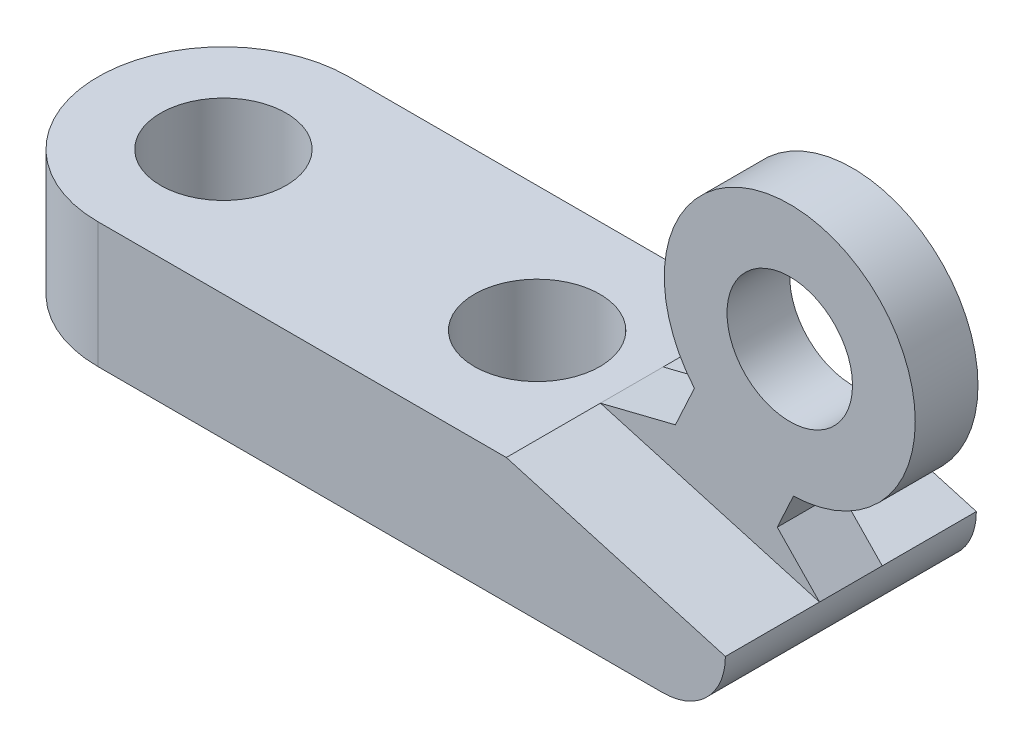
ISO-10303-21;
HEADER;
FILE_DESCRIPTION(('STEP AP214'),'2;1');
FILE_NAME('part.step','',(''),(''),'','','');
FILE_SCHEMA(('AUTOMOTIVE_DESIGN { 1 0 10303 214 1 1 1 1 }'));
ENDSEC;
DATA;
#1=APPLICATION_CONTEXT('core data for automotive mechanical design processes');
#2=APPLICATION_PROTOCOL_DEFINITION('international standard','automotive_design',2000,#1);
#3=PRODUCT_CONTEXT('',#1,'mechanical');
#4=PRODUCT('Part','Part','',(#3));
#5=PRODUCT_RELATED_PRODUCT_CATEGORY('part','',(#4));
#6=PRODUCT_DEFINITION_FORMATION('','',#4);
#7=PRODUCT_DEFINITION_CONTEXT('part definition',#1,'design');
#8=PRODUCT_DEFINITION('design','',#6,#7);
#9=PRODUCT_DEFINITION_SHAPE('','',#8);
#10=(LENGTH_UNIT() NAMED_UNIT(*) SI_UNIT(.MILLI.,.METRE.));
#11=(NAMED_UNIT(*) PLANE_ANGLE_UNIT() SI_UNIT($,.RADIAN.));
#12=(NAMED_UNIT(*) SI_UNIT($,.STERADIAN.) SOLID_ANGLE_UNIT());
#13=UNCERTAINTY_MEASURE_WITH_UNIT(LENGTH_MEASURE(1.E-05),#10,'distance_accuracy_value','');
#14=(GEOMETRIC_REPRESENTATION_CONTEXT(3) GLOBAL_UNCERTAINTY_ASSIGNED_CONTEXT((#13)) GLOBAL_UNIT_ASSIGNED_CONTEXT((#10,
#11,#12)) REPRESENTATION_CONTEXT('',''));
#15=CARTESIAN_POINT('',(0.,0.,0.));
#16=DIRECTION('',(0.,0.,1.));
#17=DIRECTION('',(1.,0.,0.));
#18=AXIS2_PLACEMENT_3D('',#15,#16,#17);
#19=CARTESIAN_POINT('',(3.52133230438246,-1.62558923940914,-0.25));
#20=DIRECTION('',(0.907924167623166,-0.419134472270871,0.));
#21=DIRECTION('',(0.419134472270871,0.907924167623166,0.));
#22=AXIS2_PLACEMENT_3D('',#19,#20,#21);
#23=PLANE('',#22);
#24=DIRECTION('',(0.419134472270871,0.907924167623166,0.));
#25=VECTOR('',#24,1.);
#26=CARTESIAN_POINT('',(3.52133230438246,-1.62558923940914,0.25));
#27=LINE('',#26,#25);
#28=CARTESIAN_POINT('',(4.66340297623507,0.848350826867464,0.25));
#29=VERTEX_POINT('',#28);
#30=CARTESIAN_POINT('',(4.79237589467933,1.12773044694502,0.25));
#31=VERTEX_POINT('',#30);
#32=EDGE_CURVE('E139',#29,#31,#27,.T.);
#33=ORIENTED_EDGE('',*,*,#32,.F.);
#34=DIRECTION('',(0.,0.,1.));
#35=VECTOR('',#34,1.);
#36=CARTESIAN_POINT('',(4.66340297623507,0.848350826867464,-0.25));
#37=LINE('',#36,#35);
#38=CARTESIAN_POINT('',(4.66340297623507,0.848350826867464,-0.25));
#39=VERTEX_POINT('',#38);
#40=EDGE_CURVE('E12',#39,#29,#37,.T.);
#41=ORIENTED_EDGE('',*,*,#40,.F.);
#42=DIRECTION('',(0.419134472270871,0.907924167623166,0.));
#43=VECTOR('',#42,1.);
#44=CARTESIAN_POINT('',(3.52133230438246,-1.62558923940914,-0.25));
#45=LINE('',#44,#43);
#46=CARTESIAN_POINT('',(4.79237589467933,1.12773044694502,-0.25));
#47=VERTEX_POINT('',#46);
#48=EDGE_CURVE('E156',#39,#47,#45,.T.);
#49=ORIENTED_EDGE('',*,*,#48,.T.);
#50=DIRECTION('',(0.,0.,1.));
#51=VECTOR('',#50,1.);
#52=CARTESIAN_POINT('',(4.79237589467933,1.12773044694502,-0.25));
#53=LINE('',#52,#51);
#54=EDGE_CURVE('E54',#47,#31,#53,.T.);
#55=ORIENTED_EDGE('',*,*,#54,.T.);
#56=EDGE_LOOP('',(#33,#41,#49,#55));
#57=FACE_BOUND('',#56,.T.);
#58=ADVANCED_FACE('F51',(#57),#23,.T.);
#59=CARTESIAN_POINT('',(2.8356282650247,2.73995053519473,-0.25));
#60=DIRECTION('',(0.719134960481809,0.694870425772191,0.));
#61=DIRECTION('',(-0.694870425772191,0.719134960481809,0.));
#62=AXIS2_PLACEMENT_3D('',#59,#60,#61);
#63=PLANE('',#62);
#64=DIRECTION('',(-0.694870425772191,0.719134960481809,0.));
#65=VECTOR('',#64,1.);
#66=CARTESIAN_POINT('',(2.8356282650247,2.73995053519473,0.25));
#67=LINE('',#66,#65);
#68=CARTESIAN_POINT('',(5.,0.5,0.25));
#69=VERTEX_POINT('',#68);
#70=EDGE_CURVE('E151',#69,#29,#67,.T.);
#71=ORIENTED_EDGE('',*,*,#70,.F.);
#72=DIRECTION('',(0.,0.,1.));
#73=VECTOR('',#72,1.);
#74=CARTESIAN_POINT('',(5.,0.5,-0.25));
#75=LINE('',#74,#73);
#76=CARTESIAN_POINT('',(5.,0.5,-0.25));
#77=VERTEX_POINT('',#76);
#78=EDGE_CURVE('E60',#77,#69,#75,.T.);
#79=ORIENTED_EDGE('',*,*,#78,.F.);
#80=DIRECTION('',(-0.694870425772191,0.719134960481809,0.));
#81=VECTOR('',#80,1.);
#82=CARTESIAN_POINT('',(2.8356282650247,2.73995053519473,-0.25));
#83=LINE('',#82,#81);
#84=EDGE_CURVE('E117',#77,#39,#83,.T.);
#85=ORIENTED_EDGE('',*,*,#84,.T.);
#86=ORIENTED_EDGE('',*,*,#40,.T.);
#87=EDGE_LOOP('',(#71,#79,#85,#86));
#88=FACE_BOUND('',#87,.T.);
#89=ADVANCED_FACE('F166',(#88),#63,.T.);
#90=CARTESIAN_POINT('',(0.511453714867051,1.78563787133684,-0.25));
#91=DIRECTION('',(0.275353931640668,0.961342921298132,0.));
#92=DIRECTION('',(-0.961342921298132,0.275353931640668,0.));
#93=AXIS2_PLACEMENT_3D('',#90,#91,#92);
#94=PLANE('',#93);
#95=DIRECTION('',(-0.961342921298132,0.275353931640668,0.));
#96=VECTOR('',#95,1.);
#97=CARTESIAN_POINT('',(0.511453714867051,1.78563787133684,0.25));
#98=LINE('',#97,#96);
#99=CARTESIAN_POINT('',(3.25435047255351,1.,0.25));
#100=VERTEX_POINT('',#99);
#101=EDGE_CURVE('E121',#69,#100,#98,.T.);
#102=ORIENTED_EDGE('',*,*,#101,.T.);
#103=DIRECTION('',(0.,0.,1.));
#104=VECTOR('',#103,1.);
#105=CARTESIAN_POINT('',(3.25435047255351,1.,-0.25));
#106=LINE('',#105,#104);
#107=CARTESIAN_POINT('',(3.25435047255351,1.,-0.25));
#108=VERTEX_POINT('',#107);
#109=EDGE_CURVE('E119',#108,#100,#106,.T.);
#110=ORIENTED_EDGE('',*,*,#109,.F.);
#111=DIRECTION('',(-0.961342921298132,0.275353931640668,0.));
#112=VECTOR('',#111,1.);
#113=CARTESIAN_POINT('',(0.511453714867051,1.78563787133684,-0.25));
#114=LINE('',#113,#112);
#115=EDGE_CURVE('E111',#77,#108,#114,.T.);
#116=ORIENTED_EDGE('',*,*,#115,.F.);
#117=ORIENTED_EDGE('',*,*,#78,.T.);
#118=EDGE_LOOP('',(#102,#110,#116,#117));
#119=FACE_BOUND('',#118,.T.);
#120=ADVANCED_FACE('F120',(#119),#94,.F.);
#121=CARTESIAN_POINT('',(-0.044080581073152,0.176575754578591,-0.25));
#122=DIRECTION('',(-0.242207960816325,0.97022435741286,0.));
#123=DIRECTION('',(-0.97022435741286,-0.242207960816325,0.));
#124=AXIS2_PLACEMENT_3D('',#121,#122,#123);
#125=PLANE('',#124);
#126=DIRECTION('',(-0.97022435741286,-0.242207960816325,0.));
#127=VECTOR('',#126,1.);
#128=CARTESIAN_POINT('',(-0.044080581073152,0.176575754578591,0.25));
#129=LINE('',#128,#127);
#130=CARTESIAN_POINT('',(3.85181055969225,1.14915064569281,0.25));
#131=VERTEX_POINT('',#130);
#132=EDGE_CURVE('E148',#131,#100,#129,.T.);
#133=ORIENTED_EDGE('',*,*,#132,.F.);
#134=DIRECTION('',(0.,0.,1.));
#135=VECTOR('',#134,1.);
#136=CARTESIAN_POINT('',(3.85181055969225,1.14915064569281,-0.25));
#137=LINE('',#136,#135);
#138=CARTESIAN_POINT('',(3.85181055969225,1.14915064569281,-0.25));
#139=VERTEX_POINT('',#138);
#140=EDGE_CURVE('E125',#139,#131,#137,.T.);
#141=ORIENTED_EDGE('',*,*,#140,.F.);
#142=DIRECTION('',(-0.97022435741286,-0.242207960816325,0.));
#143=VECTOR('',#142,1.);
#144=CARTESIAN_POINT('',(-0.044080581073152,0.176575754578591,-0.25));
#145=LINE('',#144,#143);
#146=EDGE_CURVE('E116',#139,#108,#145,.T.);
#147=ORIENTED_EDGE('',*,*,#146,.T.);
#148=ORIENTED_EDGE('',*,*,#109,.T.);
#149=EDGE_LOOP('',(#133,#141,#147,#148));
#150=FACE_BOUND('',#149,.T.);
#151=ADVANCED_FACE('F127',(#150),#125,.T.);
#152=CARTESIAN_POINT('',(2.73784827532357,-1.26390136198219,-0.25));
#153=DIRECTION('',(0.907924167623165,-0.419134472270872,0.));
#154=DIRECTION('',(0.419134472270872,0.907924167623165,0.));
#155=AXIS2_PLACEMENT_3D('',#152,#153,#154);
#156=PLANE('',#155);
#157=DIRECTION('',(0.419134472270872,0.907924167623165,0.));
#158=VECTOR('',#157,1.);
#159=CARTESIAN_POINT('',(2.73784827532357,-1.26390136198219,0.25));
#160=LINE('',#159,#158);
#161=CARTESIAN_POINT('',(4.00321309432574,1.47711703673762,0.25));
#162=VERTEX_POINT('',#161);
#163=EDGE_CURVE('E145',#131,#162,#160,.T.);
#164=ORIENTED_EDGE('',*,*,#163,.T.);
#165=DIRECTION('',(0.,0.,1.));
#166=VECTOR('',#165,1.);
#167=CARTESIAN_POINT('',(4.00321309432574,1.47711703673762,-0.25));
#168=LINE('',#167,#166);
#169=CARTESIAN_POINT('',(4.00321309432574,1.47711703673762,-0.25));
#170=VERTEX_POINT('',#169);
#171=EDGE_CURVE('E159',#170,#162,#168,.T.);
#172=ORIENTED_EDGE('',*,*,#171,.F.);
#173=DIRECTION('',(0.419134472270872,0.907924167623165,0.));
#174=VECTOR('',#173,1.);
#175=CARTESIAN_POINT('',(2.73784827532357,-1.26390136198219,-0.25));
#176=LINE('',#175,#174);
#177=EDGE_CURVE('E129',#139,#170,#176,.T.);
#178=ORIENTED_EDGE('',*,*,#177,.F.);
#179=ORIENTED_EDGE('',*,*,#140,.T.);
#180=EDGE_LOOP('',(#164,#172,#178,#179));
#181=FACE_BOUND('',#180,.T.);
#182=ADVANCED_FACE('F180',(#181),#156,.F.);
#183=CARTESIAN_POINT('',(4.76299192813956,2.12729864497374,-0.25));
#184=DIRECTION('',(0.,0.,1.));
#185=DIRECTION('',(1.,0.,0.));
#186=AXIS2_PLACEMENT_3D('',#183,#184,#185);
#187=CYLINDRICAL_SURFACE('',#186,1.);
#188=CARTESIAN_POINT('',(4.76299192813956,2.12729864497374,0.25));
#189=DIRECTION('',(0.,0.,1.));
#190=DIRECTION('',(1.,0.,0.));
#191=AXIS2_PLACEMENT_3D('',#188,#189,#190);
#192=CIRCLE('',#191,1.);
#193=EDGE_CURVE('E142',#31,#162,#192,.T.);
#194=ORIENTED_EDGE('',*,*,#193,.F.);
#195=ORIENTED_EDGE('',*,*,#54,.F.);
#196=CARTESIAN_POINT('',(4.76299192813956,2.12729864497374,-0.25));
#197=DIRECTION('',(0.,0.,1.));
#198=DIRECTION('',(1.,0.,0.));
#199=AXIS2_PLACEMENT_3D('',#196,#197,#198);
#200=CIRCLE('',#199,1.);
#201=EDGE_CURVE('E131',#47,#170,#200,.T.);
#202=ORIENTED_EDGE('',*,*,#201,.T.);
#203=ORIENTED_EDGE('',*,*,#171,.T.);
#204=EDGE_LOOP('',(#194,#195,#202,#203));
#205=FACE_BOUND('',#204,.T.);
#206=ADVANCED_FACE('F161',(#205),#187,.T.);
#207=CARTESIAN_POINT('',(4.76299192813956,2.12729864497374,-0.25));
#208=DIRECTION('',(0.,0.,1.));
#209=DIRECTION('',(1.,0.,0.));
#210=AXIS2_PLACEMENT_3D('',#207,#208,#209);
#211=CYLINDRICAL_SURFACE('',#210,0.500000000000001);
#212=CARTESIAN_POINT('',(4.76299192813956,2.12729864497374,-0.25));
#213=DIRECTION('',(0.,0.,1.));
#214=DIRECTION('',(1.,0.,0.));
#215=AXIS2_PLACEMENT_3D('',#212,#213,#214);
#216=CIRCLE('',#215,0.500000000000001);
#217=CARTESIAN_POINT('',(5.26299192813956,2.12729864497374,-0.25));
#218=VERTEX_POINT('',#217);
#219=EDGE_CURVE('E136',#218,#218,#216,.T.);
#220=ORIENTED_EDGE('',*,*,#219,.F.);
#221=EDGE_LOOP('',(#220));
#222=FACE_BOUND('',#221,.T.);
#223=CARTESIAN_POINT('',(4.76299192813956,2.12729864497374,0.25));
#224=DIRECTION('',(0.,0.,1.));
#225=DIRECTION('',(1.,0.,0.));
#226=AXIS2_PLACEMENT_3D('',#223,#224,#225);
#227=CIRCLE('',#226,0.500000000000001);
#228=CARTESIAN_POINT('',(5.26299192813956,2.12729864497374,0.25));
#229=VERTEX_POINT('',#228);
#230=EDGE_CURVE('E154',#229,#229,#227,.T.);
#231=ORIENTED_EDGE('',*,*,#230,.T.);
#232=EDGE_LOOP('',(#231));
#233=FACE_BOUND('',#232,.T.);
#234=ADVANCED_FACE('F175',(#222,#233),#211,.F.);
#235=CARTESIAN_POINT('',(0.,0.,-0.25));
#236=DIRECTION('',(0.,0.,1.));
#237=DIRECTION('',(1.,0.,0.));
#238=AXIS2_PLACEMENT_3D('',#235,#236,#237);
#239=PLANE('',#238);
#240=ORIENTED_EDGE('',*,*,#48,.F.);
#241=ORIENTED_EDGE('',*,*,#84,.F.);
#242=ORIENTED_EDGE('',*,*,#115,.T.);
#243=ORIENTED_EDGE('',*,*,#146,.F.);
#244=ORIENTED_EDGE('',*,*,#177,.T.);
#245=ORIENTED_EDGE('',*,*,#201,.F.);
#246=EDGE_LOOP('',(#240,#241,#242,#243,#244,#245));
#247=FACE_BOUND('',#246,.T.);
#248=ORIENTED_EDGE('',*,*,#219,.T.);
#249=EDGE_LOOP('',(#248));
#250=FACE_BOUND('',#249,.T.);
#251=ADVANCED_FACE('F113',(#247,#250),#239,.F.);
#252=CARTESIAN_POINT('',(0.,0.,0.25));
#253=DIRECTION('',(0.,0.,1.));
#254=DIRECTION('',(1.,0.,0.));
#255=AXIS2_PLACEMENT_3D('',#252,#253,#254);
#256=PLANE('',#255);
#257=ORIENTED_EDGE('',*,*,#32,.T.);
#258=ORIENTED_EDGE('',*,*,#193,.T.);
#259=ORIENTED_EDGE('',*,*,#163,.F.);
#260=ORIENTED_EDGE('',*,*,#132,.T.);
#261=ORIENTED_EDGE('',*,*,#101,.F.);
#262=ORIENTED_EDGE('',*,*,#70,.T.);
#263=EDGE_LOOP('',(#257,#258,#259,#260,#261,#262));
#264=FACE_BOUND('',#263,.T.);
#265=ORIENTED_EDGE('',*,*,#230,.F.);
#266=EDGE_LOOP('',(#265));
#267=FACE_BOUND('',#266,.T.);
#268=ADVANCED_FACE('F164',(#264,#267),#256,.T.);
#269=CLOSED_SHELL('',(#58,#89,#120,#151,#182,#206,#234,#251,#268));
#270=MANIFOLD_SOLID_BREP('B2',#269);
#271=CARTESIAN_POINT('',(0.,1.,-1.));
#272=DIRECTION('',(0.,0.,-1.));
#273=DIRECTION('',(-1.,0.,0.));
#274=AXIS2_PLACEMENT_3D('',#271,#272,#273);
#275=PLANE('',#274);
#276=DIRECTION('',(0.961342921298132,-0.275353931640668,0.));
#277=VECTOR('',#276,1.);
#278=CARTESIAN_POINT('',(5.,0.5,-1.));
#279=LINE('',#278,#277);
#280=CARTESIAN_POINT('',(3.25435047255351,1.,-1.));
#281=VERTEX_POINT('',#280);
#282=CARTESIAN_POINT('',(5.,0.5,-1.));
#283=VERTEX_POINT('',#282);
#284=EDGE_CURVE('E309',#281,#283,#279,.T.);
#285=ORIENTED_EDGE('',*,*,#284,.T.);
#286=CARTESIAN_POINT('',(4.5,0.5,-1.));
#287=DIRECTION('',(0.,0.,-1.));
#288=DIRECTION('',(-1.,0.,0.));
#289=AXIS2_PLACEMENT_3D('',#286,#287,#288);
#290=CIRCLE('',#289,0.5);
#291=CARTESIAN_POINT('',(4.5,0.,-1.));
#292=VERTEX_POINT('',#291);
#293=EDGE_CURVE('E285',#283,#292,#290,.T.);
#294=ORIENTED_EDGE('',*,*,#293,.T.);
#295=DIRECTION('',(1.,0.,0.));
#296=VECTOR('',#295,1.);
#297=CARTESIAN_POINT('',(0.,0.,-1.));
#298=LINE('',#297,#296);
#299=CARTESIAN_POINT('',(0.,0.,-1.));
#300=VERTEX_POINT('',#299);
#301=EDGE_CURVE('E346',#300,#292,#298,.T.);
#302=ORIENTED_EDGE('',*,*,#301,.F.);
#303=DIRECTION('',(0.,-1.,0.));
#304=VECTOR('',#303,1.);
#305=CARTESIAN_POINT('',(0.,1.,-1.));
#306=LINE('',#305,#304);
#307=CARTESIAN_POINT('',(0.,1.,-1.));
#308=VERTEX_POINT('',#307);
#309=EDGE_CURVE('E329',#308,#300,#306,.T.);
#310=ORIENTED_EDGE('',*,*,#309,.F.);
#311=DIRECTION('',(1.,0.,0.));
#312=VECTOR('',#311,1.);
#313=CARTESIAN_POINT('',(0.,1.,-1.));
#314=LINE('',#313,#312);
#315=EDGE_CURVE('E325',#308,#281,#314,.T.);
#316=ORIENTED_EDGE('',*,*,#315,.T.);
#317=EDGE_LOOP('',(#285,#294,#302,#310,#316));
#318=FACE_BOUND('',#317,.T.);
#319=ADVANCED_FACE('F263',(#318),#275,.T.);
#320=CARTESIAN_POINT('',(0.,1.,0.));
#321=DIRECTION('',(0.,-1.,0.));
#322=DIRECTION('',(0.,0.,-1.));
#323=AXIS2_PLACEMENT_3D('',#320,#321,#322);
#324=CYLINDRICAL_SURFACE('',#323,1.);
#325=CARTESIAN_POINT('',(0.,0.,0.));
#326=DIRECTION('',(0.,1.,0.));
#327=DIRECTION('',(0.,0.,1.));
#328=AXIS2_PLACEMENT_3D('',#325,#326,#327);
#329=CIRCLE('',#328,1.);
#330=CARTESIAN_POINT('',(0.,0.,1.));
#331=VERTEX_POINT('',#330);
#332=EDGE_CURVE('E348',#300,#331,#329,.T.);
#333=ORIENTED_EDGE('',*,*,#332,.T.);
#334=DIRECTION('',(0.,-1.,0.));
#335=VECTOR('',#334,1.);
#336=CARTESIAN_POINT('',(0.,1.,1.));
#337=LINE('',#336,#335);
#338=CARTESIAN_POINT('',(0.,1.,1.));
#339=VERTEX_POINT('',#338);
#340=EDGE_CURVE('E343',#339,#331,#337,.T.);
#341=ORIENTED_EDGE('',*,*,#340,.F.);
#342=CARTESIAN_POINT('',(0.,1.,0.));
#343=DIRECTION('',(0.,1.,0.));
#344=DIRECTION('',(0.,0.,1.));
#345=AXIS2_PLACEMENT_3D('',#342,#343,#344);
#346=CIRCLE('',#345,1.);
#347=EDGE_CURVE('E331',#308,#339,#346,.T.);
#348=ORIENTED_EDGE('',*,*,#347,.F.);
#349=ORIENTED_EDGE('',*,*,#309,.T.);
#350=EDGE_LOOP('',(#333,#341,#348,#349));
#351=FACE_BOUND('',#350,.T.);
#352=ADVANCED_FACE('F361',(#351),#324,.T.);
#353=CARTESIAN_POINT('',(0.,1.,1.));
#354=DIRECTION('',(0.,0.,-1.));
#355=DIRECTION('',(-1.,0.,0.));
#356=AXIS2_PLACEMENT_3D('',#353,#354,#355);
#357=PLANE('',#356);
#358=CARTESIAN_POINT('',(4.5,0.5,1.));
#359=DIRECTION('',(0.,0.,-1.));
#360=DIRECTION('',(-1.,0.,0.));
#361=AXIS2_PLACEMENT_3D('',#358,#359,#360);
#362=CIRCLE('',#361,0.5);
#363=CARTESIAN_POINT('',(4.5,0.,1.));
#364=VERTEX_POINT('',#363);
#365=CARTESIAN_POINT('',(5.,0.5,1.));
#366=VERTEX_POINT('',#365);
#367=EDGE_CURVE('E49',#364,#366,#362,.F.);
#368=ORIENTED_EDGE('',*,*,#367,.T.);
#369=DIRECTION('',(0.961342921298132,-0.275353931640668,0.));
#370=VECTOR('',#369,1.);
#371=CARTESIAN_POINT('',(5.,0.5,1.));
#372=LINE('',#371,#370);
#373=CARTESIAN_POINT('',(3.25435047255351,1.,1.));
#374=VERTEX_POINT('',#373);
#375=EDGE_CURVE('E327',#374,#366,#372,.T.);
#376=ORIENTED_EDGE('',*,*,#375,.F.);
#377=DIRECTION('',(1.,0.,0.));
#378=VECTOR('',#377,1.);
#379=CARTESIAN_POINT('',(0.,1.,1.));
#380=LINE('',#379,#378);
#381=EDGE_CURVE('E326',#339,#374,#380,.T.);
#382=ORIENTED_EDGE('',*,*,#381,.F.);
#383=ORIENTED_EDGE('',*,*,#340,.T.);
#384=DIRECTION('',(1.,0.,0.));
#385=VECTOR('',#384,1.);
#386=CARTESIAN_POINT('',(0.,0.,1.));
#387=LINE('',#386,#385);
#388=EDGE_CURVE('E351',#331,#364,#387,.T.);
#389=ORIENTED_EDGE('',*,*,#388,.T.);
#390=EDGE_LOOP('',(#368,#376,#382,#383,#389));
#391=FACE_BOUND('',#390,.T.);
#392=ADVANCED_FACE('F367',(#391),#357,.F.);
#393=CARTESIAN_POINT('',(2.5,1.,0.));
#394=DIRECTION('',(0.,-1.,0.));
#395=DIRECTION('',(0.,0.,-1.));
#396=AXIS2_PLACEMENT_3D('',#393,#394,#395);
#397=CYLINDRICAL_SURFACE('',#396,0.5);
#398=CARTESIAN_POINT('',(2.5,1.,0.));
#399=DIRECTION('',(0.,1.,0.));
#400=DIRECTION('',(0.,0.,1.));
#401=AXIS2_PLACEMENT_3D('',#398,#399,#400);
#402=CIRCLE('',#401,0.5);
#403=CARTESIAN_POINT('',(2.5,1.,0.5));
#404=VERTEX_POINT('',#403);
#405=EDGE_CURVE('E332',#404,#404,#402,.T.);
#406=ORIENTED_EDGE('',*,*,#405,.T.);
#407=EDGE_LOOP('',(#406));
#408=FACE_BOUND('',#407,.T.);
#409=CARTESIAN_POINT('',(2.5,0.,0.));
#410=DIRECTION('',(0.,1.,0.));
#411=DIRECTION('',(0.,0.,1.));
#412=AXIS2_PLACEMENT_3D('',#409,#410,#411);
#413=CIRCLE('',#412,0.5);
#414=CARTESIAN_POINT('',(2.5,0.,0.5));
#415=VERTEX_POINT('',#414);
#416=EDGE_CURVE('E317',#415,#415,#413,.T.);
#417=ORIENTED_EDGE('',*,*,#416,.F.);
#418=EDGE_LOOP('',(#417));
#419=FACE_BOUND('',#418,.T.);
#420=ADVANCED_FACE('F387',(#408,#419),#397,.F.);
#421=CARTESIAN_POINT('',(0.,1.,0.));
#422=DIRECTION('',(0.,-1.,0.));
#423=DIRECTION('',(0.,0.,-1.));
#424=AXIS2_PLACEMENT_3D('',#421,#422,#423);
#425=CYLINDRICAL_SURFACE('',#424,0.5);
#426=CARTESIAN_POINT('',(0.,1.,0.));
#427=DIRECTION('',(0.,1.,0.));
#428=DIRECTION('',(0.,0.,1.));
#429=AXIS2_PLACEMENT_3D('',#426,#427,#428);
#430=CIRCLE('',#429,0.5);
#431=CARTESIAN_POINT('',(0.,1.,0.5));
#432=VERTEX_POINT('',#431);
#433=EDGE_CURVE('E340',#432,#432,#430,.T.);
#434=ORIENTED_EDGE('',*,*,#433,.T.);
#435=EDGE_LOOP('',(#434));
#436=FACE_BOUND('',#435,.T.);
#437=CARTESIAN_POINT('',(0.,0.,0.));
#438=DIRECTION('',(0.,1.,0.));
#439=DIRECTION('',(0.,0.,1.));
#440=AXIS2_PLACEMENT_3D('',#437,#438,#439);
#441=CIRCLE('',#440,0.5);
#442=CARTESIAN_POINT('',(0.,0.,0.5));
#443=VERTEX_POINT('',#442);
#444=EDGE_CURVE('E336',#443,#443,#441,.T.);
#445=ORIENTED_EDGE('',*,*,#444,.F.);
#446=EDGE_LOOP('',(#445));
#447=FACE_BOUND('',#446,.T.);
#448=ADVANCED_FACE('F389',(#436,#447),#425,.F.);
#449=CARTESIAN_POINT('',(0.,1.,0.));
#450=DIRECTION('',(0.,1.,0.));
#451=DIRECTION('',(0.,0.,1.));
#452=AXIS2_PLACEMENT_3D('',#449,#450,#451);
#453=PLANE('',#452);
#454=DIRECTION('',(0.,0.,1.));
#455=VECTOR('',#454,1.);
#456=CARTESIAN_POINT('',(3.25435047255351,1.,-2.81584478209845));
#457=LINE('',#456,#455);
#458=EDGE_CURVE('E312',#281,#374,#457,.T.);
#459=ORIENTED_EDGE('',*,*,#458,.F.);
#460=ORIENTED_EDGE('',*,*,#315,.F.);
#461=ORIENTED_EDGE('',*,*,#347,.T.);
#462=ORIENTED_EDGE('',*,*,#381,.T.);
#463=EDGE_LOOP('',(#459,#460,#461,#462));
#464=FACE_BOUND('',#463,.T.);
#465=ORIENTED_EDGE('',*,*,#405,.F.);
#466=EDGE_LOOP('',(#465));
#467=FACE_BOUND('',#466,.T.);
#468=ORIENTED_EDGE('',*,*,#433,.F.);
#469=EDGE_LOOP('',(#468));
#470=FACE_BOUND('',#469,.T.);
#471=ADVANCED_FACE('F322',(#464,#467,#470),#453,.T.);
#472=CARTESIAN_POINT('',(0.,0.,0.));
#473=DIRECTION('',(0.,1.,0.));
#474=DIRECTION('',(0.,0.,1.));
#475=AXIS2_PLACEMENT_3D('',#472,#473,#474);
#476=PLANE('',#475);
#477=ORIENTED_EDGE('',*,*,#416,.T.);
#478=EDGE_LOOP('',(#477));
#479=FACE_BOUND('',#478,.T.);
#480=ORIENTED_EDGE('',*,*,#301,.T.);
#481=DIRECTION('',(0.,0.,-1.));
#482=VECTOR('',#481,1.);
#483=CARTESIAN_POINT('',(4.5,0.,0.));
#484=LINE('',#483,#482);
#485=EDGE_CURVE('E271',#292,#364,#484,.F.);
#486=ORIENTED_EDGE('',*,*,#485,.T.);
#487=ORIENTED_EDGE('',*,*,#388,.F.);
#488=ORIENTED_EDGE('',*,*,#332,.F.);
#489=EDGE_LOOP('',(#480,#486,#487,#488));
#490=FACE_BOUND('',#489,.T.);
#491=ORIENTED_EDGE('',*,*,#444,.T.);
#492=EDGE_LOOP('',(#491));
#493=FACE_BOUND('',#492,.T.);
#494=ADVANCED_FACE('F363',(#479,#490,#493),#476,.F.);
#495=CARTESIAN_POINT('',(4.5,0.5,0.));
#496=DIRECTION('',(0.,0.,-1.));
#497=DIRECTION('',(-1.,0.,0.));
#498=AXIS2_PLACEMENT_3D('',#495,#496,#497);
#499=CYLINDRICAL_SURFACE('',#498,0.5);
#500=ORIENTED_EDGE('',*,*,#367,.F.);
#501=ORIENTED_EDGE('',*,*,#485,.F.);
#502=ORIENTED_EDGE('',*,*,#293,.F.);
#503=DIRECTION('',(0.,0.,-1.));
#504=VECTOR('',#503,1.);
#505=CARTESIAN_POINT('',(5.,0.5,0.));
#506=LINE('',#505,#504);
#507=EDGE_CURVE('E315',#366,#283,#506,.T.);
#508=ORIENTED_EDGE('',*,*,#507,.F.);
#509=EDGE_LOOP('',(#500,#501,#502,#508));
#510=FACE_BOUND('',#509,.T.);
#511=ADVANCED_FACE('F265',(#510),#499,.T.);
#512=CARTESIAN_POINT('',(5.,0.5,-2.81584478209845));
#513=DIRECTION('',(-0.275353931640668,-0.961342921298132,0.));
#514=DIRECTION('',(0.961342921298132,-0.275353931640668,0.));
#515=AXIS2_PLACEMENT_3D('',#512,#513,#514);
#516=PLANE('',#515);
#517=ORIENTED_EDGE('',*,*,#458,.T.);
#518=ORIENTED_EDGE('',*,*,#375,.T.);
#519=ORIENTED_EDGE('',*,*,#507,.T.);
#520=ORIENTED_EDGE('',*,*,#284,.F.);
#521=EDGE_LOOP('',(#517,#518,#519,#520));
#522=FACE_BOUND('',#521,.T.);
#523=ADVANCED_FACE('F311',(#522),#516,.F.);
#524=CLOSED_SHELL('',(#319,#352,#392,#420,#448,#471,#494,#511,#523));
#525=MANIFOLD_SOLID_BREP('B6',#524);
#526=ADVANCED_BREP_SHAPE_REPRESENTATION('',(#18,#270,#525),#14);
#527=SHAPE_DEFINITION_REPRESENTATION(#9,#526);
ENDSEC;
END-ISO-10303-21;
